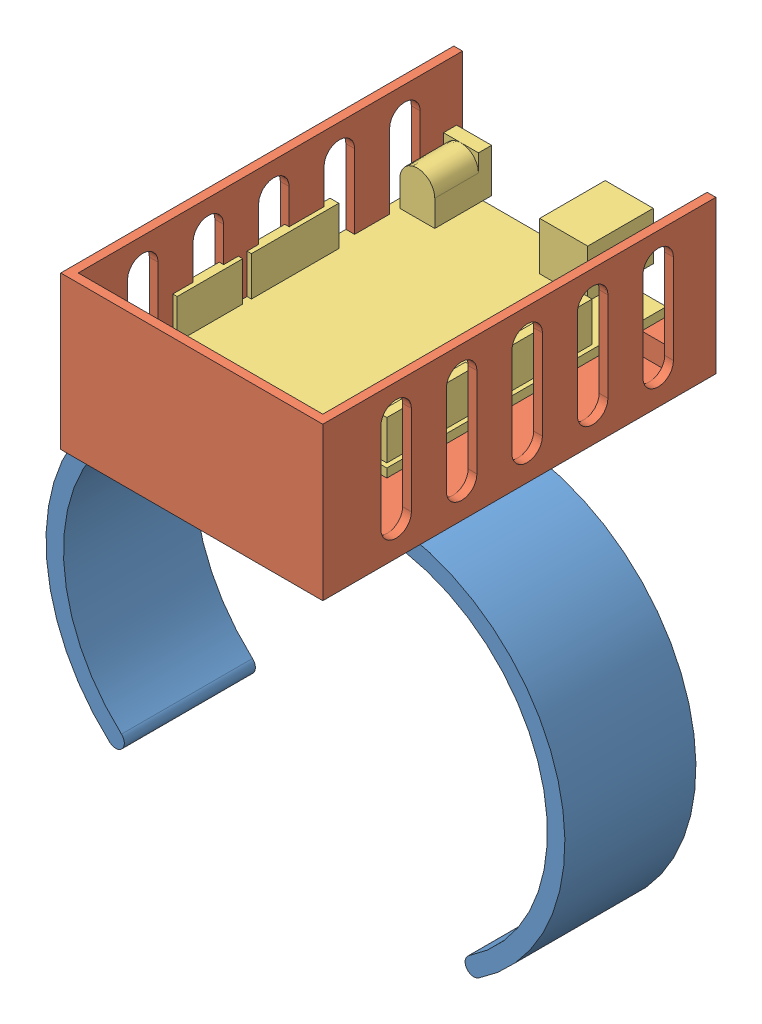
SolidWorks assembly support bras.SLDASM, configuration Défaut (file format 10000). Lengths in mm.
Overall size (118.81 116 93.65).
3 component instances, 3 part files, 5 mates.
Components (placement in the parent):
- serre bras-1: serre bras.SLDPRT [Défaut] at (-38.8291 33.4614 112.7497) size (118.81 81 30)
- boitier cartes-1: boitier cartes.SLDPRT [Défaut] at (10.9709 37.4614 76.4497) x (-0.000002 0 1) z (0 1 0) size (90 60 35)
- carte arduino simplifié-1: carte arduino simplifié.SLDPRT [Défaut] at (2.9778 48.4614 143.7941) x (0.000002 0 -1) z (0 -1 0) size (73.18 52 13)
Mates (geometry in assembly coordinates):
- Coaxiale2: concentric aligned: cylinder of serre bras-1 through (-31.8291 33.4614 119.7497) axis (0 -1 0) radius 2.4; circle of boitier cartes-1
- Coïncidente1: coincident anti-aligned: plane of serre bras-1 through (-39.1595 37.4614 142.7497) normal (0 1 0); plane of boitier cartes-1 through (10.9709 37.4614 76.4497) normal (0 -1 0)
- Coaxiale5: concentric aligned: circle of serre bras-1; circle of boitier cartes-1
- Distance1: distance = 5 mm anti-aligned: plane of boitier cartes-1 through (10.9709 41.4614 76.4497) normal (0 1 0); plane of carte arduino simplifié-1 through (2.9778 46.4614 143.7941) normal (0 -1 0)
- Parallèle1: parallel aligned: plane of boitier cartes-1 through (8.9708 41.4614 164.4497) normal (-1 0 -0.000002); plane of carte arduino simplifié-1 through (-49.0222 46.4614 143.794) normal (-1 0 -0.000002)
